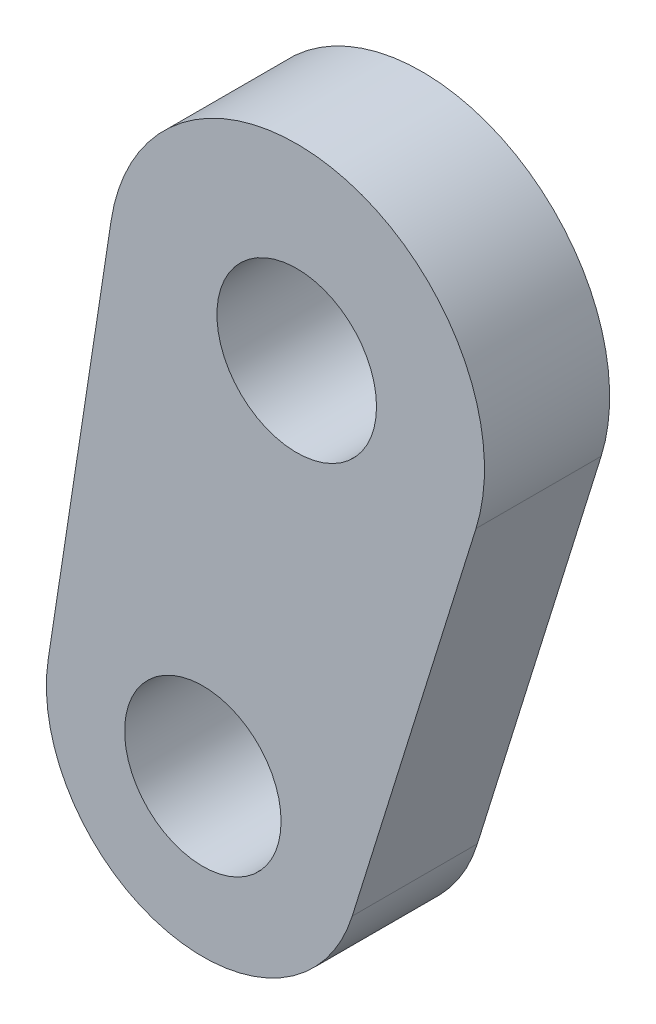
from build123d import *

# Parameters (mm, degrees)
SK_PATILLA_R   = 5.1
SK_PATILLA_R_2 = 5
PATILLA_DEPTH  = 8


with BuildPart() as part:
    # Sk_Patilla → Patilla (new body)
    with BuildSketch(Plane.XY.offset(44.4)):
        with BuildLine():
            Line((3.547963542, -28.972606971), (11.45755625, -3.567128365))
            ThreePointArc((11.45755625, -3.567128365), (2.69831408, 11.692694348), (-11.862050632, 1.814319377))
            Line((-11.862050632, 1.814319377), (-15.885042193, -24.488067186))
            ThreePointArc((-15.885042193, -24.488067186), (-8.248595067, -35.743911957), (3.547963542, -28.972606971))
        make_face()
        Circle(SK_PATILLA_R, mode=Mode.SUBTRACT)
        with Locations((-6, -26)):
            Circle(SK_PATILLA_R_2, mode=Mode.SUBTRACT)
    extrude(amount=PATILLA_DEPTH)


solid = part.part
